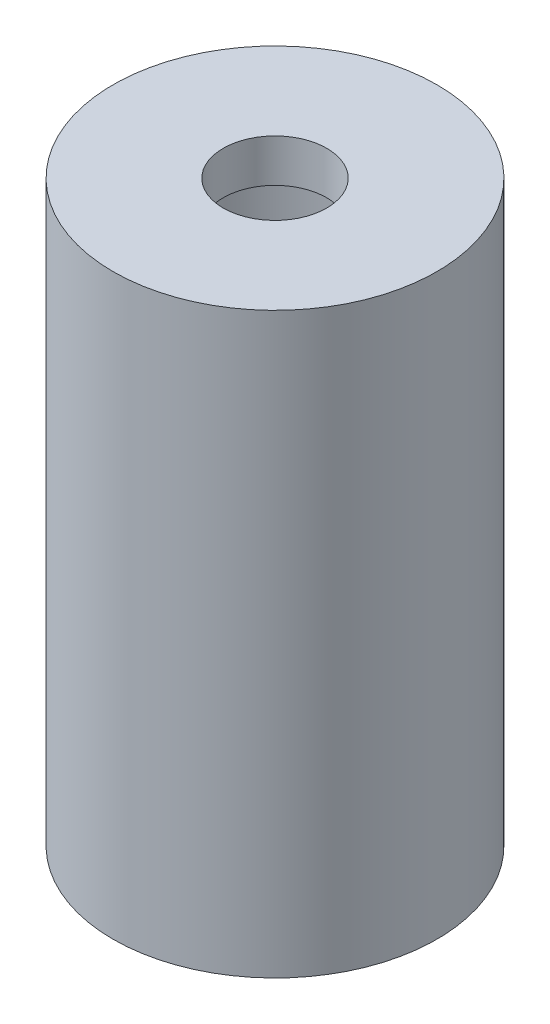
from build123d import *

# Parameters (mm, degrees)
SKETCH1_R           = 37.8
SKETCH1_R_2         = 27.8
BOSS_EXTRUDE1_DEPTH = 125
SKETCH2_R           = 37.8
BOSS_EXTRUDE2_DEPTH = 10
SKETCH4_R           = 12.089597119
CUT_EXTRUDE1_DEPTH  = 10


with BuildPart() as part:
    # Sketch1 → Boss-Extrude1 (new body)
    with BuildSketch(Plane(origin=(0, 0, 0), x_dir=(1, 0, 0), z_dir=(0, 1, 0))):
        with Locations(Location((0, 0, 0), (0, 0, 270))):
            Circle(SKETCH1_R)
        with Locations(Location((0, 0, 0), (0, 0, 270))):
            Circle(SKETCH1_R_2, mode=Mode.SUBTRACT)
    extrude(amount=BOSS_EXTRUDE1_DEPTH)

    # Sketch2 → Boss-Extrude2 (add)
    with BuildSketch(Plane(origin=(0, 125, 0), x_dir=(1, 0, 0), z_dir=(0, 1, 0))):
        with Locations(Location((0, 0, 0), (0, 0, 270))):
            Circle(SKETCH2_R)
    extrude(amount=BOSS_EXTRUDE2_DEPTH)

    # Sketch4 → Cut-Extrude1 (cut)
    with BuildSketch(Plane(origin=(0, 135, 0), x_dir=(1, 0, 0), z_dir=(0, 1, 0))):
        with Locations(Location((0, 0, 0), (0, 0, 270))):
            Circle(SKETCH4_R)
    extrude(amount=-CUT_EXTRUDE1_DEPTH, mode=Mode.SUBTRACT)


solid = part.part
